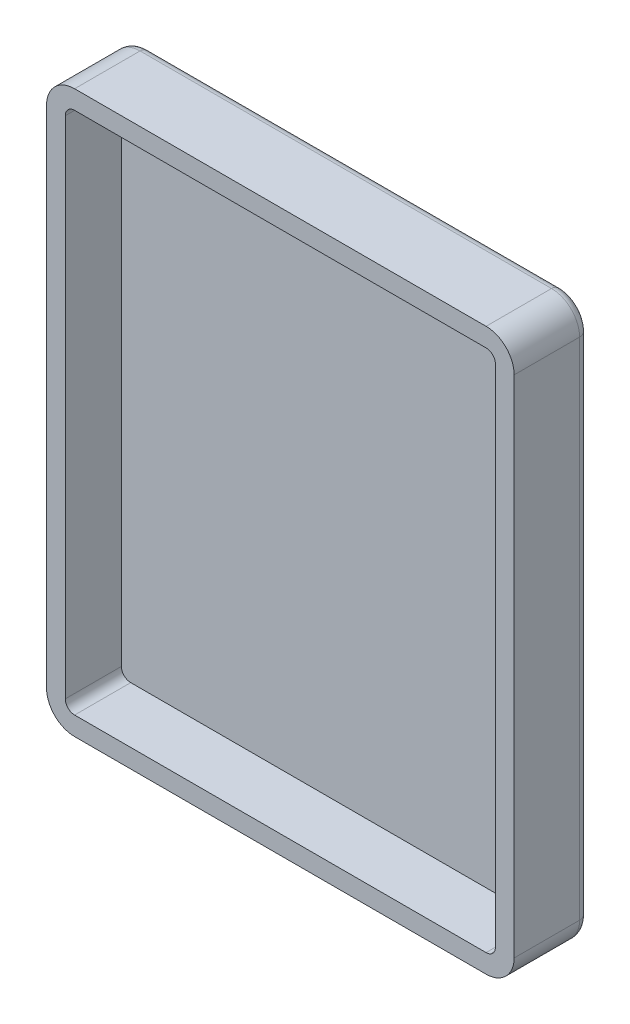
ISO-10303-21;
HEADER;
FILE_DESCRIPTION(('STEP AP214'),'2;1');
FILE_NAME('part.step','',(''),(''),'','','');
FILE_SCHEMA(('AUTOMOTIVE_DESIGN { 1 0 10303 214 1 1 1 1 }'));
ENDSEC;
DATA;
#1=APPLICATION_CONTEXT('core data for automotive mechanical design processes');
#2=APPLICATION_PROTOCOL_DEFINITION('international standard','automotive_design',2000,#1);
#3=PRODUCT_CONTEXT('',#1,'mechanical');
#4=PRODUCT('Part','Part','',(#3));
#5=PRODUCT_RELATED_PRODUCT_CATEGORY('part','',(#4));
#6=PRODUCT_DEFINITION_FORMATION('','',#4);
#7=PRODUCT_DEFINITION_CONTEXT('part definition',#1,'design');
#8=PRODUCT_DEFINITION('design','',#6,#7);
#9=PRODUCT_DEFINITION_SHAPE('','',#8);
#10=(LENGTH_UNIT() NAMED_UNIT(*) SI_UNIT(.MILLI.,.METRE.));
#11=(NAMED_UNIT(*) PLANE_ANGLE_UNIT() SI_UNIT($,.RADIAN.));
#12=(NAMED_UNIT(*) SI_UNIT($,.STERADIAN.) SOLID_ANGLE_UNIT());
#13=UNCERTAINTY_MEASURE_WITH_UNIT(LENGTH_MEASURE(1.E-05),#10,'distance_accuracy_value','');
#14=(GEOMETRIC_REPRESENTATION_CONTEXT(3) GLOBAL_UNCERTAINTY_ASSIGNED_CONTEXT((#13)) GLOBAL_UNIT_ASSIGNED_CONTEXT((#10,
#11,#12)) REPRESENTATION_CONTEXT('',''));
#15=CARTESIAN_POINT('',(0.,0.,0.));
#16=DIRECTION('',(0.,0.,1.));
#17=DIRECTION('',(1.,0.,0.));
#18=AXIS2_PLACEMENT_3D('',#15,#16,#17);
#19=CARTESIAN_POINT('',(0.,0.,8.));
#20=DIRECTION('',(0.,0.,-1.));
#21=DIRECTION('',(-1.,0.,0.));
#22=AXIS2_PLACEMENT_3D('',#19,#20,#21);
#23=PLANE('',#22);
#24=DIRECTION('',(1.,0.,0.));
#25=VECTOR('',#24,1.);
#26=CARTESIAN_POINT('',(3.,2.,8.));
#27=LINE('',#26,#25);
#28=CARTESIAN_POINT('',(3.,2.,8.));
#29=VERTEX_POINT('',#28);
#30=CARTESIAN_POINT('',(47.,2.,8.));
#31=VERTEX_POINT('',#30);
#32=EDGE_CURVE('E218',#29,#31,#27,.T.);
#33=ORIENTED_EDGE('',*,*,#32,.F.);
#34=CARTESIAN_POINT('',(3.,3.,8.));
#35=DIRECTION('',(0.,0.,1.));
#36=DIRECTION('',(1.,0.,0.));
#37=AXIS2_PLACEMENT_3D('',#34,#35,#36);
#38=CIRCLE('',#37,1.);
#39=CARTESIAN_POINT('',(2.,3.,8.));
#40=VERTEX_POINT('',#39);
#41=EDGE_CURVE('E55',#40,#29,#38,.T.);
#42=ORIENTED_EDGE('',*,*,#41,.F.);
#43=DIRECTION('',(0.,-1.,0.));
#44=VECTOR('',#43,1.);
#45=CARTESIAN_POINT('',(2.,57.,8.));
#46=LINE('',#45,#44);
#47=CARTESIAN_POINT('',(2.,57.,8.));
#48=VERTEX_POINT('',#47);
#49=EDGE_CURVE('E198',#48,#40,#46,.T.);
#50=ORIENTED_EDGE('',*,*,#49,.F.);
#51=CARTESIAN_POINT('',(3.,57.,8.));
#52=DIRECTION('',(0.,0.,1.));
#53=DIRECTION('',(1.,0.,0.));
#54=AXIS2_PLACEMENT_3D('',#51,#52,#53);
#55=CIRCLE('',#54,1.);
#56=CARTESIAN_POINT('',(3.,58.,8.));
#57=VERTEX_POINT('',#56);
#58=EDGE_CURVE('E201',#57,#48,#55,.T.);
#59=ORIENTED_EDGE('',*,*,#58,.F.);
#60=DIRECTION('',(-1.,0.,0.));
#61=VECTOR('',#60,1.);
#62=CARTESIAN_POINT('',(47.,58.,8.));
#63=LINE('',#62,#61);
#64=CARTESIAN_POINT('',(47.,58.,8.));
#65=VERTEX_POINT('',#64);
#66=EDGE_CURVE('E229',#65,#57,#63,.T.);
#67=ORIENTED_EDGE('',*,*,#66,.F.);
#68=CARTESIAN_POINT('',(47.,57.,8.));
#69=DIRECTION('',(0.,0.,1.));
#70=DIRECTION('',(1.,0.,0.));
#71=AXIS2_PLACEMENT_3D('',#68,#69,#70);
#72=CIRCLE('',#71,1.);
#73=CARTESIAN_POINT('',(48.,57.,8.));
#74=VERTEX_POINT('',#73);
#75=EDGE_CURVE('E226',#74,#65,#72,.T.);
#76=ORIENTED_EDGE('',*,*,#75,.F.);
#77=DIRECTION('',(0.,1.,0.));
#78=VECTOR('',#77,1.);
#79=CARTESIAN_POINT('',(48.,3.,8.));
#80=LINE('',#79,#78);
#81=CARTESIAN_POINT('',(48.,3.,8.));
#82=VERTEX_POINT('',#81);
#83=EDGE_CURVE('E223',#82,#74,#80,.T.);
#84=ORIENTED_EDGE('',*,*,#83,.F.);
#85=CARTESIAN_POINT('',(47.,3.,8.));
#86=DIRECTION('',(0.,0.,1.));
#87=DIRECTION('',(1.,0.,0.));
#88=AXIS2_PLACEMENT_3D('',#85,#86,#87);
#89=CIRCLE('',#88,1.);
#90=EDGE_CURVE('E220',#31,#82,#89,.T.);
#91=ORIENTED_EDGE('',*,*,#90,.F.);
#92=EDGE_LOOP('',(#33,#42,#50,#59,#67,#76,#84,#91));
#93=FACE_BOUND('',#92,.T.);
#94=DIRECTION('',(1.,0.,0.));
#95=VECTOR('',#94,1.);
#96=CARTESIAN_POINT('',(0.,0.,8.));
#97=LINE('',#96,#95);
#98=CARTESIAN_POINT('',(3.,0.,8.));
#99=VERTEX_POINT('',#98);
#100=CARTESIAN_POINT('',(47.,0.,8.));
#101=VERTEX_POINT('',#100);
#102=EDGE_CURVE('E251',#99,#101,#97,.T.);
#103=ORIENTED_EDGE('',*,*,#102,.T.);
#104=CARTESIAN_POINT('',(47.,3.,8.));
#105=DIRECTION('',(0.,0.,-1.));
#106=DIRECTION('',(-1.,0.,0.));
#107=AXIS2_PLACEMENT_3D('',#104,#105,#106);
#108=CIRCLE('',#107,3.);
#109=CARTESIAN_POINT('',(50.,3.,8.));
#110=VERTEX_POINT('',#109);
#111=EDGE_CURVE('E273',#101,#110,#108,.F.);
#112=ORIENTED_EDGE('',*,*,#111,.T.);
#113=DIRECTION('',(0.,1.,0.));
#114=VECTOR('',#113,1.);
#115=CARTESIAN_POINT('',(50.,0.,8.));
#116=LINE('',#115,#114);
#117=CARTESIAN_POINT('',(50.,57.,8.));
#118=VERTEX_POINT('',#117);
#119=EDGE_CURVE('E254',#110,#118,#116,.T.);
#120=ORIENTED_EDGE('',*,*,#119,.T.);
#121=CARTESIAN_POINT('',(47.,57.,8.));
#122=DIRECTION('',(0.,0.,-1.));
#123=DIRECTION('',(-1.,0.,0.));
#124=AXIS2_PLACEMENT_3D('',#121,#122,#123);
#125=CIRCLE('',#124,3.);
#126=CARTESIAN_POINT('',(47.,60.,8.));
#127=VERTEX_POINT('',#126);
#128=EDGE_CURVE('E267',#118,#127,#125,.F.);
#129=ORIENTED_EDGE('',*,*,#128,.T.);
#130=DIRECTION('',(-1.,0.,0.));
#131=VECTOR('',#130,1.);
#132=CARTESIAN_POINT('',(0.,60.,8.));
#133=LINE('',#132,#131);
#134=CARTESIAN_POINT('',(3.,60.,8.));
#135=VERTEX_POINT('',#134);
#136=EDGE_CURVE('E257',#127,#135,#133,.T.);
#137=ORIENTED_EDGE('',*,*,#136,.T.);
#138=CARTESIAN_POINT('',(3.,57.,8.));
#139=DIRECTION('',(0.,0.,-1.));
#140=DIRECTION('',(-1.,0.,0.));
#141=AXIS2_PLACEMENT_3D('',#138,#139,#140);
#142=CIRCLE('',#141,3.);
#143=CARTESIAN_POINT('',(0.,57.,8.));
#144=VERTEX_POINT('',#143);
#145=EDGE_CURVE('E269',#135,#144,#142,.F.);
#146=ORIENTED_EDGE('',*,*,#145,.T.);
#147=DIRECTION('',(0.,-1.,0.));
#148=VECTOR('',#147,1.);
#149=CARTESIAN_POINT('',(0.,0.,8.));
#150=LINE('',#149,#148);
#151=CARTESIAN_POINT('',(0.,3.,8.));
#152=VERTEX_POINT('',#151);
#153=EDGE_CURVE('E248',#144,#152,#150,.T.);
#154=ORIENTED_EDGE('',*,*,#153,.T.);
#155=CARTESIAN_POINT('',(3.,3.,8.));
#156=DIRECTION('',(0.,0.,-1.));
#157=DIRECTION('',(-1.,0.,0.));
#158=AXIS2_PLACEMENT_3D('',#155,#156,#157);
#159=CIRCLE('',#158,3.);
#160=EDGE_CURVE('E271',#152,#99,#159,.F.);
#161=ORIENTED_EDGE('',*,*,#160,.T.);
#162=EDGE_LOOP('',(#103,#112,#120,#129,#137,#146,#154,#161));
#163=FACE_BOUND('',#162,.T.);
#164=ADVANCED_FACE('F38',(#93,#163),#23,.F.);
#165=CARTESIAN_POINT('',(0.,0.,8.));
#166=DIRECTION('',(1.,0.,0.));
#167=DIRECTION('',(0.,0.,-1.));
#168=AXIS2_PLACEMENT_3D('',#165,#166,#167);
#169=PLANE('',#168);
#170=DIRECTION('',(0.,0.,-1.));
#171=VECTOR('',#170,1.);
#172=CARTESIAN_POINT('',(0.,57.,8.));
#173=LINE('',#172,#171);
#174=CARTESIAN_POINT('',(0.,57.,1.));
#175=VERTEX_POINT('',#174);
#176=EDGE_CURVE('E275',#144,#175,#173,.T.);
#177=ORIENTED_EDGE('',*,*,#176,.T.);
#178=DIRECTION('',(0.,-1.,0.));
#179=VECTOR('',#178,1.);
#180=CARTESIAN_POINT('',(0.,3.,1.));
#181=LINE('',#180,#179);
#182=CARTESIAN_POINT('',(0.,3.,1.));
#183=VERTEX_POINT('',#182);
#184=EDGE_CURVE('E308',#175,#183,#181,.T.);
#185=ORIENTED_EDGE('',*,*,#184,.T.);
#186=DIRECTION('',(0.,0.,-1.));
#187=VECTOR('',#186,1.);
#188=CARTESIAN_POINT('',(0.,3.,8.));
#189=LINE('',#188,#187);
#190=EDGE_CURVE('E277',#183,#152,#189,.F.);
#191=ORIENTED_EDGE('',*,*,#190,.T.);
#192=ORIENTED_EDGE('',*,*,#153,.F.);
#193=EDGE_LOOP('',(#177,#185,#191,#192));
#194=FACE_BOUND('',#193,.T.);
#195=ADVANCED_FACE('F354',(#194),#169,.F.);
#196=CARTESIAN_POINT('',(0.,0.,8.));
#197=DIRECTION('',(0.,1.,0.));
#198=DIRECTION('',(0.,0.,1.));
#199=AXIS2_PLACEMENT_3D('',#196,#197,#198);
#200=PLANE('',#199);
#201=DIRECTION('',(0.,0.,-1.));
#202=VECTOR('',#201,1.);
#203=CARTESIAN_POINT('',(3.,0.,8.));
#204=LINE('',#203,#202);
#205=CARTESIAN_POINT('',(3.,0.,1.));
#206=VERTEX_POINT('',#205);
#207=EDGE_CURVE('E263',#99,#206,#204,.T.);
#208=ORIENTED_EDGE('',*,*,#207,.T.);
#209=DIRECTION('',(1.,0.,0.));
#210=VECTOR('',#209,1.);
#211=CARTESIAN_POINT('',(47.,0.,1.));
#212=LINE('',#211,#210);
#213=CARTESIAN_POINT('',(47.,0.,1.));
#214=VERTEX_POINT('',#213);
#215=EDGE_CURVE('E313',#206,#214,#212,.T.);
#216=ORIENTED_EDGE('',*,*,#215,.T.);
#217=DIRECTION('',(0.,0.,-1.));
#218=VECTOR('',#217,1.);
#219=CARTESIAN_POINT('',(47.,0.,8.));
#220=LINE('',#219,#218);
#221=EDGE_CURVE('E265',#214,#101,#220,.F.);
#222=ORIENTED_EDGE('',*,*,#221,.T.);
#223=ORIENTED_EDGE('',*,*,#102,.F.);
#224=EDGE_LOOP('',(#208,#216,#222,#223));
#225=FACE_BOUND('',#224,.T.);
#226=ADVANCED_FACE('F389',(#225),#200,.F.);
#227=CARTESIAN_POINT('',(50.,0.,8.));
#228=DIRECTION('',(-1.,0.,0.));
#229=DIRECTION('',(0.,0.,1.));
#230=AXIS2_PLACEMENT_3D('',#227,#228,#229);
#231=PLANE('',#230);
#232=DIRECTION('',(0.,0.,-1.));
#233=VECTOR('',#232,1.);
#234=CARTESIAN_POINT('',(50.,3.,8.));
#235=LINE('',#234,#233);
#236=CARTESIAN_POINT('',(50.,3.,1.));
#237=VERTEX_POINT('',#236);
#238=EDGE_CURVE('E62',#110,#237,#235,.T.);
#239=ORIENTED_EDGE('',*,*,#238,.T.);
#240=DIRECTION('',(0.,1.,0.));
#241=VECTOR('',#240,1.);
#242=CARTESIAN_POINT('',(50.,57.,1.));
#243=LINE('',#242,#241);
#244=CARTESIAN_POINT('',(50.,57.,1.));
#245=VERTEX_POINT('',#244);
#246=EDGE_CURVE('E12',#237,#245,#243,.T.);
#247=ORIENTED_EDGE('',*,*,#246,.T.);
#248=DIRECTION('',(0.,0.,-1.));
#249=VECTOR('',#248,1.);
#250=CARTESIAN_POINT('',(50.,57.,8.));
#251=LINE('',#250,#249);
#252=EDGE_CURVE('E260',#245,#118,#251,.F.);
#253=ORIENTED_EDGE('',*,*,#252,.T.);
#254=ORIENTED_EDGE('',*,*,#119,.F.);
#255=EDGE_LOOP('',(#239,#247,#253,#254));
#256=FACE_BOUND('',#255,.T.);
#257=ADVANCED_FACE('F391',(#256),#231,.F.);
#258=CARTESIAN_POINT('',(0.,60.,8.));
#259=DIRECTION('',(0.,-1.,0.));
#260=DIRECTION('',(0.,0.,-1.));
#261=AXIS2_PLACEMENT_3D('',#258,#259,#260);
#262=PLANE('',#261);
#263=DIRECTION('',(0.,0.,-1.));
#264=VECTOR('',#263,1.);
#265=CARTESIAN_POINT('',(47.,60.,8.));
#266=LINE('',#265,#264);
#267=CARTESIAN_POINT('',(47.,60.,1.));
#268=VERTEX_POINT('',#267);
#269=EDGE_CURVE('E279',#127,#268,#266,.T.);
#270=ORIENTED_EDGE('',*,*,#269,.T.);
#271=DIRECTION('',(-1.,0.,0.));
#272=VECTOR('',#271,1.);
#273=CARTESIAN_POINT('',(3.,60.,1.));
#274=LINE('',#273,#272);
#275=CARTESIAN_POINT('',(3.,60.,1.));
#276=VERTEX_POINT('',#275);
#277=EDGE_CURVE('E303',#268,#276,#274,.T.);
#278=ORIENTED_EDGE('',*,*,#277,.T.);
#279=DIRECTION('',(0.,0.,-1.));
#280=VECTOR('',#279,1.);
#281=CARTESIAN_POINT('',(3.,60.,8.));
#282=LINE('',#281,#280);
#283=EDGE_CURVE('E281',#276,#135,#282,.F.);
#284=ORIENTED_EDGE('',*,*,#283,.T.);
#285=ORIENTED_EDGE('',*,*,#136,.F.);
#286=EDGE_LOOP('',(#270,#278,#284,#285));
#287=FACE_BOUND('',#286,.T.);
#288=ADVANCED_FACE('F423',(#287),#262,.F.);
#289=CARTESIAN_POINT('',(0.,0.,0.));
#290=DIRECTION('',(0.,0.,-1.));
#291=DIRECTION('',(-1.,0.,0.));
#292=AXIS2_PLACEMENT_3D('',#289,#290,#291);
#293=PLANE('',#292);
#294=DIRECTION('',(-1.,0.,0.));
#295=VECTOR('',#294,1.);
#296=CARTESIAN_POINT('',(47.,59.,0.));
#297=LINE('',#296,#295);
#298=CARTESIAN_POINT('',(3.,59.,0.));
#299=VERTEX_POINT('',#298);
#300=CARTESIAN_POINT('',(47.,59.,0.));
#301=VERTEX_POINT('',#300);
#302=EDGE_CURVE('E295',#299,#301,#297,.F.);
#303=ORIENTED_EDGE('',*,*,#302,.T.);
#304=CARTESIAN_POINT('',(47.,57.,0.));
#305=DIRECTION('',(0.,0.,-1.));
#306=DIRECTION('',(-1.,0.,0.));
#307=AXIS2_PLACEMENT_3D('',#304,#305,#306);
#308=CIRCLE('',#307,2.);
#309=CARTESIAN_POINT('',(49.,57.,0.));
#310=VERTEX_POINT('',#309);
#311=EDGE_CURVE('E297',#301,#310,#308,.T.);
#312=ORIENTED_EDGE('',*,*,#311,.T.);
#313=DIRECTION('',(0.,1.,0.));
#314=VECTOR('',#313,1.);
#315=CARTESIAN_POINT('',(49.,3.,0.));
#316=LINE('',#315,#314);
#317=CARTESIAN_POINT('',(49.,3.,0.));
#318=VERTEX_POINT('',#317);
#319=EDGE_CURVE('E283',#310,#318,#316,.F.);
#320=ORIENTED_EDGE('',*,*,#319,.T.);
#321=CARTESIAN_POINT('',(47.,3.,0.));
#322=DIRECTION('',(0.,0.,-1.));
#323=DIRECTION('',(-1.,0.,0.));
#324=AXIS2_PLACEMENT_3D('',#321,#322,#323);
#325=CIRCLE('',#324,2.);
#326=CARTESIAN_POINT('',(47.,1.,0.));
#327=VERTEX_POINT('',#326);
#328=EDGE_CURVE('E285',#318,#327,#325,.T.);
#329=ORIENTED_EDGE('',*,*,#328,.T.);
#330=DIRECTION('',(1.,0.,0.));
#331=VECTOR('',#330,1.);
#332=CARTESIAN_POINT('',(3.,1.,0.));
#333=LINE('',#332,#331);
#334=CARTESIAN_POINT('',(3.,1.,0.));
#335=VERTEX_POINT('',#334);
#336=EDGE_CURVE('E287',#327,#335,#333,.F.);
#337=ORIENTED_EDGE('',*,*,#336,.T.);
#338=CARTESIAN_POINT('',(3.,3.,0.));
#339=DIRECTION('',(0.,0.,-1.));
#340=DIRECTION('',(-1.,0.,0.));
#341=AXIS2_PLACEMENT_3D('',#338,#339,#340);
#342=CIRCLE('',#341,2.);
#343=CARTESIAN_POINT('',(1.,3.,0.));
#344=VERTEX_POINT('',#343);
#345=EDGE_CURVE('E289',#335,#344,#342,.T.);
#346=ORIENTED_EDGE('',*,*,#345,.T.);
#347=DIRECTION('',(0.,-1.,0.));
#348=VECTOR('',#347,1.);
#349=CARTESIAN_POINT('',(1.,57.,0.));
#350=LINE('',#349,#348);
#351=CARTESIAN_POINT('',(1.,57.,0.));
#352=VERTEX_POINT('',#351);
#353=EDGE_CURVE('E291',#344,#352,#350,.F.);
#354=ORIENTED_EDGE('',*,*,#353,.T.);
#355=CARTESIAN_POINT('',(3.,57.,0.));
#356=DIRECTION('',(0.,0.,-1.));
#357=DIRECTION('',(-1.,0.,0.));
#358=AXIS2_PLACEMENT_3D('',#355,#356,#357);
#359=CIRCLE('',#358,2.);
#360=EDGE_CURVE('E293',#352,#299,#359,.T.);
#361=ORIENTED_EDGE('',*,*,#360,.T.);
#362=EDGE_LOOP('',(#303,#312,#320,#329,#337,#346,#354,#361));
#363=FACE_BOUND('',#362,.T.);
#364=ADVANCED_FACE('F375',(#363),#293,.T.);
#365=CARTESIAN_POINT('',(47.,3.,8.));
#366=DIRECTION('',(0.,0.,-1.));
#367=DIRECTION('',(-1.,0.,0.));
#368=AXIS2_PLACEMENT_3D('',#365,#366,#367);
#369=CYLINDRICAL_SURFACE('',#368,3.);
#370=ORIENTED_EDGE('',*,*,#111,.F.);
#371=ORIENTED_EDGE('',*,*,#221,.F.);
#372=CARTESIAN_POINT('',(47.,3.,1.));
#373=DIRECTION('',(0.,0.,-1.));
#374=DIRECTION('',(-1.,0.,0.));
#375=AXIS2_PLACEMENT_3D('',#372,#373,#374);
#376=CIRCLE('',#375,3.);
#377=EDGE_CURVE('E47',#214,#237,#376,.F.);
#378=ORIENTED_EDGE('',*,*,#377,.T.);
#379=ORIENTED_EDGE('',*,*,#238,.F.);
#380=EDGE_LOOP('',(#370,#371,#378,#379));
#381=FACE_BOUND('',#380,.T.);
#382=ADVANCED_FACE('F387',(#381),#369,.T.);
#383=CARTESIAN_POINT('',(3.,3.,8.));
#384=DIRECTION('',(0.,0.,-1.));
#385=DIRECTION('',(-1.,0.,0.));
#386=AXIS2_PLACEMENT_3D('',#383,#384,#385);
#387=CYLINDRICAL_SURFACE('',#386,3.);
#388=ORIENTED_EDGE('',*,*,#160,.F.);
#389=ORIENTED_EDGE('',*,*,#190,.F.);
#390=CARTESIAN_POINT('',(3.,3.,1.));
#391=DIRECTION('',(0.,0.,-1.));
#392=DIRECTION('',(-1.,0.,0.));
#393=AXIS2_PLACEMENT_3D('',#390,#391,#392);
#394=CIRCLE('',#393,3.);
#395=EDGE_CURVE('E310',#183,#206,#394,.F.);
#396=ORIENTED_EDGE('',*,*,#395,.T.);
#397=ORIENTED_EDGE('',*,*,#207,.F.);
#398=EDGE_LOOP('',(#388,#389,#396,#397));
#399=FACE_BOUND('',#398,.T.);
#400=ADVANCED_FACE('F351',(#399),#387,.T.);
#401=CARTESIAN_POINT('',(3.,57.,8.));
#402=DIRECTION('',(0.,0.,-1.));
#403=DIRECTION('',(-1.,0.,0.));
#404=AXIS2_PLACEMENT_3D('',#401,#402,#403);
#405=CYLINDRICAL_SURFACE('',#404,3.);
#406=ORIENTED_EDGE('',*,*,#145,.F.);
#407=ORIENTED_EDGE('',*,*,#283,.F.);
#408=CARTESIAN_POINT('',(3.,57.,1.));
#409=DIRECTION('',(0.,0.,-1.));
#410=DIRECTION('',(-1.,0.,0.));
#411=AXIS2_PLACEMENT_3D('',#408,#409,#410);
#412=CIRCLE('',#411,3.);
#413=EDGE_CURVE('E305',#276,#175,#412,.F.);
#414=ORIENTED_EDGE('',*,*,#413,.T.);
#415=ORIENTED_EDGE('',*,*,#176,.F.);
#416=EDGE_LOOP('',(#406,#407,#414,#415));
#417=FACE_BOUND('',#416,.T.);
#418=ADVANCED_FACE('F362',(#417),#405,.T.);
#419=CARTESIAN_POINT('',(47.,57.,8.));
#420=DIRECTION('',(0.,0.,-1.));
#421=DIRECTION('',(-1.,0.,0.));
#422=AXIS2_PLACEMENT_3D('',#419,#420,#421);
#423=CYLINDRICAL_SURFACE('',#422,3.);
#424=ORIENTED_EDGE('',*,*,#128,.F.);
#425=ORIENTED_EDGE('',*,*,#252,.F.);
#426=CARTESIAN_POINT('',(47.,57.,1.));
#427=DIRECTION('',(0.,0.,-1.));
#428=DIRECTION('',(-1.,0.,0.));
#429=AXIS2_PLACEMENT_3D('',#426,#427,#428);
#430=CIRCLE('',#429,3.);
#431=EDGE_CURVE('E300',#245,#268,#430,.F.);
#432=ORIENTED_EDGE('',*,*,#431,.T.);
#433=ORIENTED_EDGE('',*,*,#269,.F.);
#434=EDGE_LOOP('',(#424,#425,#432,#433));
#435=FACE_BOUND('',#434,.T.);
#436=ADVANCED_FACE('F395',(#435),#423,.T.);
#437=CARTESIAN_POINT('',(3.,3.,1.));
#438=DIRECTION('',(0.,0.,-1.));
#439=DIRECTION('',(-1.,0.,0.));
#440=AXIS2_PLACEMENT_3D('',#437,#438,#439);
#441=TOROIDAL_SURFACE('',#440,2.,1.);
#442=CARTESIAN_POINT('',(3.,1.,1.));
#443=DIRECTION('',(1.,0.,0.));
#444=DIRECTION('',(0.,0.,-1.));
#445=AXIS2_PLACEMENT_3D('',#442,#443,#444);
#446=CIRCLE('',#445,1.);
#447=EDGE_CURVE('E331',#206,#335,#446,.T.);
#448=ORIENTED_EDGE('',*,*,#447,.F.);
#449=ORIENTED_EDGE('',*,*,#395,.F.);
#450=CARTESIAN_POINT('',(1.,3.,1.));
#451=DIRECTION('',(0.,1.,0.));
#452=DIRECTION('',(0.,0.,1.));
#453=AXIS2_PLACEMENT_3D('',#450,#451,#452);
#454=CIRCLE('',#453,1.);
#455=EDGE_CURVE('E42',#344,#183,#454,.T.);
#456=ORIENTED_EDGE('',*,*,#455,.F.);
#457=ORIENTED_EDGE('',*,*,#345,.F.);
#458=EDGE_LOOP('',(#448,#449,#456,#457));
#459=FACE_BOUND('',#458,.T.);
#460=ADVANCED_FACE('F40',(#459),#441,.T.);
#461=CARTESIAN_POINT('',(1.,0.,1.));
#462=DIRECTION('',(0.,1.,0.));
#463=DIRECTION('',(0.,0.,1.));
#464=AXIS2_PLACEMENT_3D('',#461,#462,#463);
#465=CYLINDRICAL_SURFACE('',#464,1.);
#466=ORIENTED_EDGE('',*,*,#455,.T.);
#467=ORIENTED_EDGE('',*,*,#184,.F.);
#468=CARTESIAN_POINT('',(1.,57.,1.));
#469=DIRECTION('',(0.,1.,0.));
#470=DIRECTION('',(0.,0.,1.));
#471=AXIS2_PLACEMENT_3D('',#468,#469,#470);
#472=CIRCLE('',#471,1.);
#473=EDGE_CURVE('E329',#352,#175,#472,.T.);
#474=ORIENTED_EDGE('',*,*,#473,.F.);
#475=ORIENTED_EDGE('',*,*,#353,.F.);
#476=EDGE_LOOP('',(#466,#467,#474,#475));
#477=FACE_BOUND('',#476,.T.);
#478=ADVANCED_FACE('F342',(#477),#465,.T.);
#479=CARTESIAN_POINT('',(0.,1.,1.));
#480=DIRECTION('',(-1.,0.,0.));
#481=DIRECTION('',(0.,0.,1.));
#482=AXIS2_PLACEMENT_3D('',#479,#480,#481);
#483=CYLINDRICAL_SURFACE('',#482,1.);
#484=ORIENTED_EDGE('',*,*,#447,.T.);
#485=ORIENTED_EDGE('',*,*,#336,.F.);
#486=CARTESIAN_POINT('',(47.,1.,1.));
#487=DIRECTION('',(1.,0.,0.));
#488=DIRECTION('',(0.,0.,-1.));
#489=AXIS2_PLACEMENT_3D('',#486,#487,#488);
#490=CIRCLE('',#489,1.);
#491=EDGE_CURVE('E326',#214,#327,#490,.T.);
#492=ORIENTED_EDGE('',*,*,#491,.F.);
#493=ORIENTED_EDGE('',*,*,#215,.F.);
#494=EDGE_LOOP('',(#484,#485,#492,#493));
#495=FACE_BOUND('',#494,.T.);
#496=ADVANCED_FACE('F378',(#495),#483,.T.);
#497=CARTESIAN_POINT('',(3.,57.,1.));
#498=DIRECTION('',(0.,0.,-1.));
#499=DIRECTION('',(-1.,0.,0.));
#500=AXIS2_PLACEMENT_3D('',#497,#498,#499);
#501=TOROIDAL_SURFACE('',#500,2.,1.);
#502=ORIENTED_EDGE('',*,*,#473,.T.);
#503=ORIENTED_EDGE('',*,*,#413,.F.);
#504=CARTESIAN_POINT('',(3.,59.,1.));
#505=DIRECTION('',(1.,0.,0.));
#506=DIRECTION('',(0.,0.,-1.));
#507=AXIS2_PLACEMENT_3D('',#504,#505,#506);
#508=CIRCLE('',#507,1.);
#509=EDGE_CURVE('E323',#299,#276,#508,.T.);
#510=ORIENTED_EDGE('',*,*,#509,.F.);
#511=ORIENTED_EDGE('',*,*,#360,.F.);
#512=EDGE_LOOP('',(#502,#503,#510,#511));
#513=FACE_BOUND('',#512,.T.);
#514=ADVANCED_FACE('F366',(#513),#501,.T.);
#515=CARTESIAN_POINT('',(47.,3.,1.));
#516=DIRECTION('',(0.,0.,-1.));
#517=DIRECTION('',(-1.,0.,0.));
#518=AXIS2_PLACEMENT_3D('',#515,#516,#517);
#519=TOROIDAL_SURFACE('',#518,2.,1.);
#520=ORIENTED_EDGE('',*,*,#491,.T.);
#521=ORIENTED_EDGE('',*,*,#328,.F.);
#522=CARTESIAN_POINT('',(49.,3.,1.));
#523=DIRECTION('',(0.,1.,0.));
#524=DIRECTION('',(0.,0.,1.));
#525=AXIS2_PLACEMENT_3D('',#522,#523,#524);
#526=CIRCLE('',#525,1.);
#527=EDGE_CURVE('E320',#237,#318,#526,.T.);
#528=ORIENTED_EDGE('',*,*,#527,.F.);
#529=ORIENTED_EDGE('',*,*,#377,.F.);
#530=EDGE_LOOP('',(#520,#521,#528,#529));
#531=FACE_BOUND('',#530,.T.);
#532=ADVANCED_FACE('F381',(#531),#519,.T.);
#533=CARTESIAN_POINT('',(0.,59.,1.));
#534=DIRECTION('',(1.,0.,0.));
#535=DIRECTION('',(0.,0.,-1.));
#536=AXIS2_PLACEMENT_3D('',#533,#534,#535);
#537=CYLINDRICAL_SURFACE('',#536,1.);
#538=ORIENTED_EDGE('',*,*,#509,.T.);
#539=ORIENTED_EDGE('',*,*,#277,.F.);
#540=CARTESIAN_POINT('',(47.,59.,1.));
#541=DIRECTION('',(1.,0.,0.));
#542=DIRECTION('',(0.,0.,-1.));
#543=AXIS2_PLACEMENT_3D('',#540,#541,#542);
#544=CIRCLE('',#543,1.);
#545=EDGE_CURVE('E317',#301,#268,#544,.T.);
#546=ORIENTED_EDGE('',*,*,#545,.F.);
#547=ORIENTED_EDGE('',*,*,#302,.F.);
#548=EDGE_LOOP('',(#538,#539,#546,#547));
#549=FACE_BOUND('',#548,.T.);
#550=ADVANCED_FACE('F371',(#549),#537,.T.);
#551=CARTESIAN_POINT('',(49.,0.,1.));
#552=DIRECTION('',(0.,-1.,0.));
#553=DIRECTION('',(0.,0.,-1.));
#554=AXIS2_PLACEMENT_3D('',#551,#552,#553);
#555=CYLINDRICAL_SURFACE('',#554,1.);
#556=ORIENTED_EDGE('',*,*,#527,.T.);
#557=ORIENTED_EDGE('',*,*,#319,.F.);
#558=CARTESIAN_POINT('',(49.,57.,1.));
#559=DIRECTION('',(0.,1.,0.));
#560=DIRECTION('',(0.,0.,1.));
#561=AXIS2_PLACEMENT_3D('',#558,#559,#560);
#562=CIRCLE('',#561,1.);
#563=EDGE_CURVE('E236',#245,#310,#562,.T.);
#564=ORIENTED_EDGE('',*,*,#563,.F.);
#565=ORIENTED_EDGE('',*,*,#246,.F.);
#566=EDGE_LOOP('',(#556,#557,#564,#565));
#567=FACE_BOUND('',#566,.T.);
#568=ADVANCED_FACE('F402',(#567),#555,.T.);
#569=CARTESIAN_POINT('',(47.,57.,1.));
#570=DIRECTION('',(0.,0.,-1.));
#571=DIRECTION('',(-1.,0.,0.));
#572=AXIS2_PLACEMENT_3D('',#569,#570,#571);
#573=TOROIDAL_SURFACE('',#572,2.,1.);
#574=ORIENTED_EDGE('',*,*,#545,.T.);
#575=ORIENTED_EDGE('',*,*,#431,.F.);
#576=ORIENTED_EDGE('',*,*,#563,.T.);
#577=ORIENTED_EDGE('',*,*,#311,.F.);
#578=EDGE_LOOP('',(#574,#575,#576,#577));
#579=FACE_BOUND('',#578,.T.);
#580=ADVANCED_FACE('F399',(#579),#573,.T.);
#581=CARTESIAN_POINT('',(3.,3.,2.));
#582=DIRECTION('',(0.,0.,1.));
#583=DIRECTION('',(1.,0.,0.));
#584=AXIS2_PLACEMENT_3D('',#581,#582,#583);
#585=CYLINDRICAL_SURFACE('',#584,1.);
#586=ORIENTED_EDGE('',*,*,#41,.T.);
#587=DIRECTION('',(0.,0.,1.));
#588=VECTOR('',#587,1.);
#589=CARTESIAN_POINT('',(3.,2.,2.));
#590=LINE('',#589,#588);
#591=CARTESIAN_POINT('',(3.,2.,2.));
#592=VERTEX_POINT('',#591);
#593=EDGE_CURVE('E175',#592,#29,#590,.T.);
#594=ORIENTED_EDGE('',*,*,#593,.F.);
#595=CARTESIAN_POINT('',(3.,3.,2.));
#596=DIRECTION('',(0.,0.,1.));
#597=DIRECTION('',(1.,0.,0.));
#598=AXIS2_PLACEMENT_3D('',#595,#596,#597);
#599=CIRCLE('',#598,1.);
#600=CARTESIAN_POINT('',(2.,3.,2.));
#601=VERTEX_POINT('',#600);
#602=EDGE_CURVE('E179',#601,#592,#599,.T.);
#603=ORIENTED_EDGE('',*,*,#602,.F.);
#604=DIRECTION('',(0.,0.,1.));
#605=VECTOR('',#604,1.);
#606=CARTESIAN_POINT('',(2.,3.,2.));
#607=LINE('',#606,#605);
#608=EDGE_CURVE('E234',#601,#40,#607,.T.);
#609=ORIENTED_EDGE('',*,*,#608,.T.);
#610=EDGE_LOOP('',(#586,#594,#603,#609));
#611=FACE_BOUND('',#610,.T.);
#612=ADVANCED_FACE('F177',(#611),#585,.F.);
#613=CARTESIAN_POINT('',(2.,57.,2.));
#614=DIRECTION('',(-1.,0.,0.));
#615=DIRECTION('',(0.,-1.,0.));
#616=AXIS2_PLACEMENT_3D('',#613,#614,#615);
#617=PLANE('',#616);
#618=ORIENTED_EDGE('',*,*,#49,.T.);
#619=ORIENTED_EDGE('',*,*,#608,.F.);
#620=DIRECTION('',(0.,-1.,0.));
#621=VECTOR('',#620,1.);
#622=CARTESIAN_POINT('',(2.,57.,2.));
#623=LINE('',#622,#621);
#624=CARTESIAN_POINT('',(2.,57.,2.));
#625=VERTEX_POINT('',#624);
#626=EDGE_CURVE('E185',#625,#601,#623,.T.);
#627=ORIENTED_EDGE('',*,*,#626,.F.);
#628=DIRECTION('',(0.,0.,1.));
#629=VECTOR('',#628,1.);
#630=CARTESIAN_POINT('',(2.,57.,2.));
#631=LINE('',#630,#629);
#632=EDGE_CURVE('E237',#625,#48,#631,.T.);
#633=ORIENTED_EDGE('',*,*,#632,.T.);
#634=EDGE_LOOP('',(#618,#619,#627,#633));
#635=FACE_BOUND('',#634,.T.);
#636=ADVANCED_FACE('F532',(#635),#617,.F.);
#637=CARTESIAN_POINT('',(3.,57.,2.));
#638=DIRECTION('',(0.,0.,1.));
#639=DIRECTION('',(1.,0.,0.));
#640=AXIS2_PLACEMENT_3D('',#637,#638,#639);
#641=CYLINDRICAL_SURFACE('',#640,1.);
#642=ORIENTED_EDGE('',*,*,#58,.T.);
#643=ORIENTED_EDGE('',*,*,#632,.F.);
#644=CARTESIAN_POINT('',(3.,57.,2.));
#645=DIRECTION('',(0.,0.,1.));
#646=DIRECTION('',(1.,0.,0.));
#647=AXIS2_PLACEMENT_3D('',#644,#645,#646);
#648=CIRCLE('',#647,1.);
#649=CARTESIAN_POINT('',(3.,58.,2.));
#650=VERTEX_POINT('',#649);
#651=EDGE_CURVE('E214',#650,#625,#648,.T.);
#652=ORIENTED_EDGE('',*,*,#651,.F.);
#653=DIRECTION('',(0.,0.,1.));
#654=VECTOR('',#653,1.);
#655=CARTESIAN_POINT('',(3.,58.,2.));
#656=LINE('',#655,#654);
#657=EDGE_CURVE('E239',#650,#57,#656,.T.);
#658=ORIENTED_EDGE('',*,*,#657,.T.);
#659=EDGE_LOOP('',(#642,#643,#652,#658));
#660=FACE_BOUND('',#659,.T.);
#661=ADVANCED_FACE('F540',(#660),#641,.F.);
#662=CARTESIAN_POINT('',(47.,58.,2.));
#663=DIRECTION('',(0.,1.,0.));
#664=DIRECTION('',(0.,0.,1.));
#665=AXIS2_PLACEMENT_3D('',#662,#663,#664);
#666=PLANE('',#665);
#667=ORIENTED_EDGE('',*,*,#66,.T.);
#668=ORIENTED_EDGE('',*,*,#657,.F.);
#669=DIRECTION('',(-1.,0.,0.));
#670=VECTOR('',#669,1.);
#671=CARTESIAN_POINT('',(47.,58.,2.));
#672=LINE('',#671,#670);
#673=CARTESIAN_POINT('',(47.,58.,2.));
#674=VERTEX_POINT('',#673);
#675=EDGE_CURVE('E211',#674,#650,#672,.T.);
#676=ORIENTED_EDGE('',*,*,#675,.F.);
#677=DIRECTION('',(0.,0.,1.));
#678=VECTOR('',#677,1.);
#679=CARTESIAN_POINT('',(47.,58.,2.));
#680=LINE('',#679,#678);
#681=EDGE_CURVE('E241',#674,#65,#680,.T.);
#682=ORIENTED_EDGE('',*,*,#681,.T.);
#683=EDGE_LOOP('',(#667,#668,#676,#682));
#684=FACE_BOUND('',#683,.T.);
#685=ADVANCED_FACE('F550',(#684),#666,.F.);
#686=CARTESIAN_POINT('',(47.,57.,2.));
#687=DIRECTION('',(0.,0.,1.));
#688=DIRECTION('',(1.,0.,0.));
#689=AXIS2_PLACEMENT_3D('',#686,#687,#688);
#690=CYLINDRICAL_SURFACE('',#689,1.);
#691=ORIENTED_EDGE('',*,*,#75,.T.);
#692=ORIENTED_EDGE('',*,*,#681,.F.);
#693=CARTESIAN_POINT('',(47.,57.,2.));
#694=DIRECTION('',(0.,0.,1.));
#695=DIRECTION('',(1.,0.,0.));
#696=AXIS2_PLACEMENT_3D('',#693,#694,#695);
#697=CIRCLE('',#696,1.);
#698=CARTESIAN_POINT('',(48.,57.,2.));
#699=VERTEX_POINT('',#698);
#700=EDGE_CURVE('E208',#699,#674,#697,.T.);
#701=ORIENTED_EDGE('',*,*,#700,.F.);
#702=DIRECTION('',(0.,0.,1.));
#703=VECTOR('',#702,1.);
#704=CARTESIAN_POINT('',(48.,57.,2.));
#705=LINE('',#704,#703);
#706=EDGE_CURVE('E243',#699,#74,#705,.T.);
#707=ORIENTED_EDGE('',*,*,#706,.T.);
#708=EDGE_LOOP('',(#691,#692,#701,#707));
#709=FACE_BOUND('',#708,.T.);
#710=ADVANCED_FACE('F560',(#709),#690,.F.);
#711=CARTESIAN_POINT('',(48.,3.,2.));
#712=DIRECTION('',(1.,0.,0.));
#713=DIRECTION('',(0.,0.,-1.));
#714=AXIS2_PLACEMENT_3D('',#711,#712,#713);
#715=PLANE('',#714);
#716=ORIENTED_EDGE('',*,*,#83,.T.);
#717=ORIENTED_EDGE('',*,*,#706,.F.);
#718=DIRECTION('',(0.,1.,0.));
#719=VECTOR('',#718,1.);
#720=CARTESIAN_POINT('',(48.,3.,2.));
#721=LINE('',#720,#719);
#722=CARTESIAN_POINT('',(48.,3.,2.));
#723=VERTEX_POINT('',#722);
#724=EDGE_CURVE('E205',#723,#699,#721,.T.);
#725=ORIENTED_EDGE('',*,*,#724,.F.);
#726=DIRECTION('',(0.,0.,1.));
#727=VECTOR('',#726,1.);
#728=CARTESIAN_POINT('',(48.,3.,2.));
#729=LINE('',#728,#727);
#730=EDGE_CURVE('E245',#723,#82,#729,.T.);
#731=ORIENTED_EDGE('',*,*,#730,.T.);
#732=EDGE_LOOP('',(#716,#717,#725,#731));
#733=FACE_BOUND('',#732,.T.);
#734=ADVANCED_FACE('F570',(#733),#715,.F.);
#735=CARTESIAN_POINT('',(47.,3.,2.));
#736=DIRECTION('',(0.,0.,1.));
#737=DIRECTION('',(1.,0.,0.));
#738=AXIS2_PLACEMENT_3D('',#735,#736,#737);
#739=CYLINDRICAL_SURFACE('',#738,1.);
#740=ORIENTED_EDGE('',*,*,#90,.T.);
#741=ORIENTED_EDGE('',*,*,#730,.F.);
#742=CARTESIAN_POINT('',(47.,3.,2.));
#743=DIRECTION('',(0.,0.,1.));
#744=DIRECTION('',(1.,0.,0.));
#745=AXIS2_PLACEMENT_3D('',#742,#743,#744);
#746=CIRCLE('',#745,1.);
#747=CARTESIAN_POINT('',(47.,2.,2.));
#748=VERTEX_POINT('',#747);
#749=EDGE_CURVE('E193',#748,#723,#746,.T.);
#750=ORIENTED_EDGE('',*,*,#749,.F.);
#751=DIRECTION('',(0.,0.,1.));
#752=VECTOR('',#751,1.);
#753=CARTESIAN_POINT('',(47.,2.,2.));
#754=LINE('',#753,#752);
#755=EDGE_CURVE('E184',#748,#31,#754,.T.);
#756=ORIENTED_EDGE('',*,*,#755,.T.);
#757=EDGE_LOOP('',(#740,#741,#750,#756));
#758=FACE_BOUND('',#757,.T.);
#759=ADVANCED_FACE('F580',(#758),#739,.F.);
#760=CARTESIAN_POINT('',(3.,2.,2.));
#761=DIRECTION('',(0.,-1.,0.));
#762=DIRECTION('',(0.,0.,-1.));
#763=AXIS2_PLACEMENT_3D('',#760,#761,#762);
#764=PLANE('',#763);
#765=ORIENTED_EDGE('',*,*,#32,.T.);
#766=ORIENTED_EDGE('',*,*,#755,.F.);
#767=DIRECTION('',(1.,0.,0.));
#768=VECTOR('',#767,1.);
#769=CARTESIAN_POINT('',(3.,2.,2.));
#770=LINE('',#769,#768);
#771=EDGE_CURVE('E188',#592,#748,#770,.T.);
#772=ORIENTED_EDGE('',*,*,#771,.F.);
#773=ORIENTED_EDGE('',*,*,#593,.T.);
#774=EDGE_LOOP('',(#765,#766,#772,#773));
#775=FACE_BOUND('',#774,.T.);
#776=ADVANCED_FACE('F189',(#775),#764,.F.);
#777=CARTESIAN_POINT('',(3.,3.,2.));
#778=DIRECTION('',(0.,0.,1.));
#779=DIRECTION('',(1.,0.,0.));
#780=AXIS2_PLACEMENT_3D('',#777,#778,#779);
#781=PLANE('',#780);
#782=ORIENTED_EDGE('',*,*,#602,.T.);
#783=ORIENTED_EDGE('',*,*,#771,.T.);
#784=ORIENTED_EDGE('',*,*,#749,.T.);
#785=ORIENTED_EDGE('',*,*,#724,.T.);
#786=ORIENTED_EDGE('',*,*,#700,.T.);
#787=ORIENTED_EDGE('',*,*,#675,.T.);
#788=ORIENTED_EDGE('',*,*,#651,.T.);
#789=ORIENTED_EDGE('',*,*,#626,.T.);
#790=EDGE_LOOP('',(#782,#783,#784,#785,#786,#787,#788,#789));
#791=FACE_BOUND('',#790,.T.);
#792=ADVANCED_FACE('F195',(#791),#781,.T.);
#793=CLOSED_SHELL('',(#164,#195,#226,#257,#288,#364,#382,#400,#418,#436,#460,#478,#496,#514,
#532,#550,#568,#580,#612,#636,#661,#685,#710,#734,#759,#776,#792));
#794=MANIFOLD_SOLID_BREP('B2',#793);
#795=ADVANCED_BREP_SHAPE_REPRESENTATION('',(#18,#794),#14);
#796=SHAPE_DEFINITION_REPRESENTATION(#9,#795);
ENDSEC;
END-ISO-10303-21;
